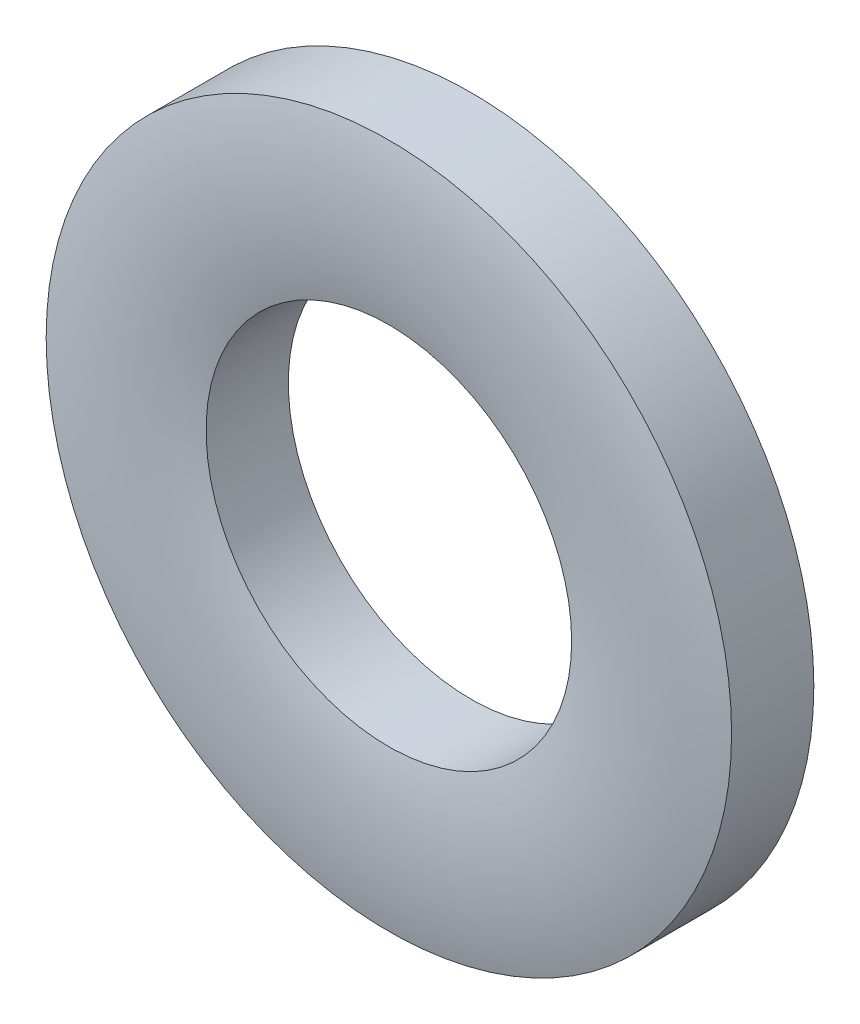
from build123d import *


with BuildPart() as part:
    # Sketch3 → Revolve1 (revolve)
    with BuildSketch(Plane(origin=(0, 0, 0), x_dir=(0, 0, -1), z_dir=(1, 0, 0)), mode=Mode.PRIVATE) as revolve1_sk:
        with BuildLine():
            Line((0.8, 6), (-0.64, 6))
            ThreePointArc((-0.64, 6), (-0.8, 4.6), (-0.64, 3.2))
            Line((-0.64, 3.2), (0.8, 3.2))
            Line((0.8, 3.2), (0.8, 6))
        make_face()
    revolve(revolve1_sk.sketch.rotate(Axis((0, 0, 0.8), (0, 0, -1)), 90), axis=Axis((0, 0, 0.8), (0, 0, -1)))


solid = part.part
